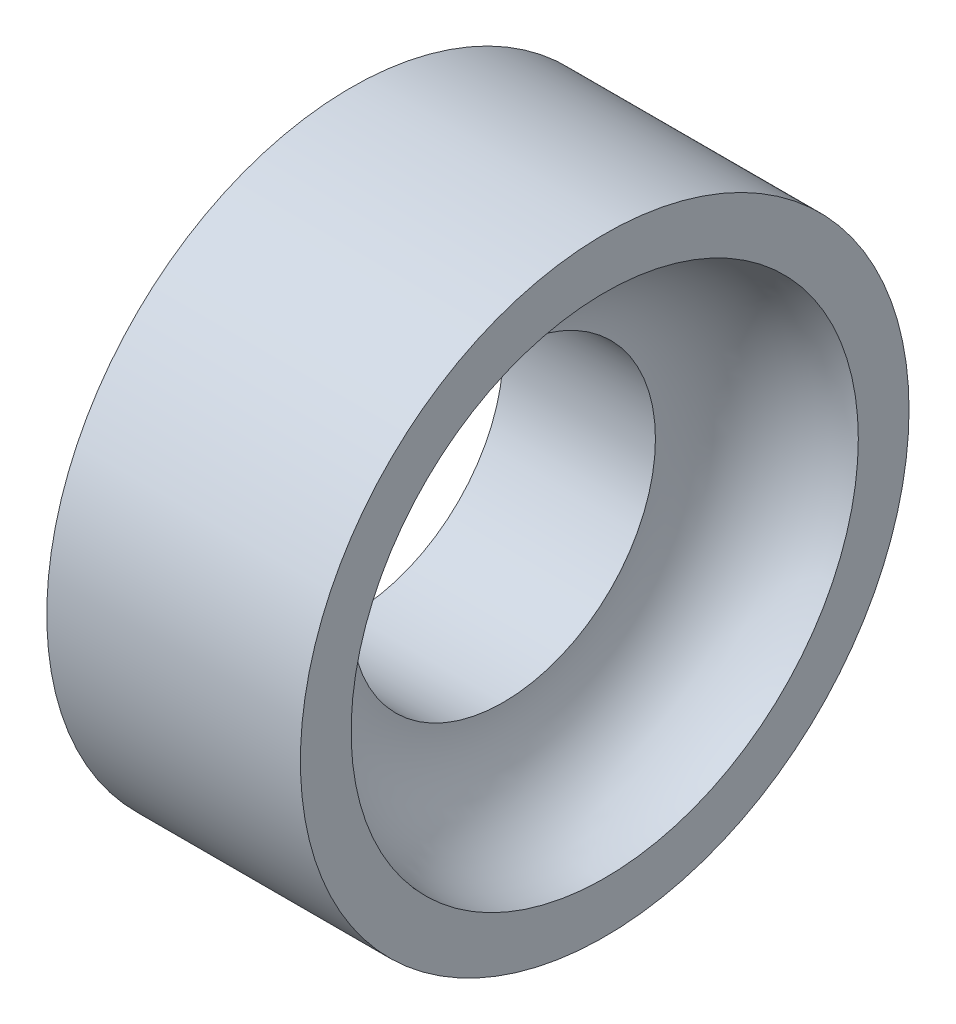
ISO-10303-21;
HEADER;
FILE_DESCRIPTION(('STEP AP214'),'2;1');
FILE_NAME('part.step','',(''),(''),'','','');
FILE_SCHEMA(('AUTOMOTIVE_DESIGN { 1 0 10303 214 1 1 1 1 }'));
ENDSEC;
DATA;
#1=APPLICATION_CONTEXT('core data for automotive mechanical design processes');
#2=APPLICATION_PROTOCOL_DEFINITION('international standard','automotive_design',2000,#1);
#3=PRODUCT_CONTEXT('',#1,'mechanical');
#4=PRODUCT('Part','Part','',(#3));
#5=PRODUCT_RELATED_PRODUCT_CATEGORY('part','',(#4));
#6=PRODUCT_DEFINITION_FORMATION('','',#4);
#7=PRODUCT_DEFINITION_CONTEXT('part definition',#1,'design');
#8=PRODUCT_DEFINITION('design','',#6,#7);
#9=PRODUCT_DEFINITION_SHAPE('','',#8);
#10=(LENGTH_UNIT() NAMED_UNIT(*) SI_UNIT(.MILLI.,.METRE.));
#11=(NAMED_UNIT(*) PLANE_ANGLE_UNIT() SI_UNIT($,.RADIAN.));
#12=(NAMED_UNIT(*) SI_UNIT($,.STERADIAN.) SOLID_ANGLE_UNIT());
#13=UNCERTAINTY_MEASURE_WITH_UNIT(LENGTH_MEASURE(1.E-05),#10,'distance_accuracy_value','');
#14=(GEOMETRIC_REPRESENTATION_CONTEXT(3) GLOBAL_UNCERTAINTY_ASSIGNED_CONTEXT((#13)) GLOBAL_UNIT_ASSIGNED_CONTEXT((#10,
#11,#12)) REPRESENTATION_CONTEXT('',''));
#15=CARTESIAN_POINT('',(0.,0.,0.));
#16=DIRECTION('',(0.,0.,1.));
#17=DIRECTION('',(1.,0.,0.));
#18=AXIS2_PLACEMENT_3D('',#15,#16,#17);
#19=CARTESIAN_POINT('',(0.,0.,0.));
#20=DIRECTION('',(-1.,0.,0.));
#21=DIRECTION('',(0.,0.,1.));
#22=AXIS2_PLACEMENT_3D('',#19,#20,#21);
#23=PLANE('',#22);
#24=CARTESIAN_POINT('',(0.,0.,0.));
#25=DIRECTION('',(1.,0.,0.));
#26=DIRECTION('',(0.,0.,-1.));
#27=AXIS2_PLACEMENT_3D('',#24,#25,#26);
#28=CIRCLE('',#27,6.);
#29=CARTESIAN_POINT('',(0.,0.,-6.));
#30=VERTEX_POINT('',#29);
#31=EDGE_CURVE('E46',#30,#30,#28,.T.);
#32=ORIENTED_EDGE('',*,*,#31,.T.);
#33=EDGE_LOOP('',(#32));
#34=FACE_BOUND('',#33,.T.);
#35=CARTESIAN_POINT('',(0.,0.,0.));
#36=DIRECTION('',(1.,0.,0.));
#37=DIRECTION('',(0.,0.,-1.));
#38=AXIS2_PLACEMENT_3D('',#35,#36,#37);
#39=CIRCLE('',#38,5.);
#40=CARTESIAN_POINT('',(0.,0.,-5.));
#41=VERTEX_POINT('',#40);
#42=EDGE_CURVE('E10',#41,#41,#39,.T.);
#43=ORIENTED_EDGE('',*,*,#42,.F.);
#44=EDGE_LOOP('',(#43));
#45=FACE_BOUND('',#44,.T.);
#46=ADVANCED_FACE('F30',(#34,#45),#23,.F.);
#47=CARTESIAN_POINT('',(-6.,0.,0.));
#48=DIRECTION('',(1.,0.,0.));
#49=DIRECTION('',(0.,0.,-1.));
#50=AXIS2_PLACEMENT_3D('',#47,#48,#49);
#51=CYLINDRICAL_SURFACE('',#50,3.);
#52=CARTESIAN_POINT('',(-5.,0.,0.));
#53=DIRECTION('',(1.,0.,0.));
#54=DIRECTION('',(0.,0.,-1.));
#55=AXIS2_PLACEMENT_3D('',#52,#53,#54);
#56=CIRCLE('',#55,3.);
#57=CARTESIAN_POINT('',(-5.,0.,-3.));
#58=VERTEX_POINT('',#57);
#59=EDGE_CURVE('E37',#58,#58,#56,.T.);
#60=ORIENTED_EDGE('',*,*,#59,.F.);
#61=EDGE_LOOP('',(#60));
#62=FACE_BOUND('',#61,.T.);
#63=CARTESIAN_POINT('',(-2.,0.,0.));
#64=DIRECTION('',(1.,0.,0.));
#65=DIRECTION('',(0.,0.,-1.));
#66=AXIS2_PLACEMENT_3D('',#63,#64,#65);
#67=CIRCLE('',#66,3.);
#68=CARTESIAN_POINT('',(-2.,0.,-3.));
#69=VERTEX_POINT('',#68);
#70=EDGE_CURVE('E33',#69,#69,#67,.T.);
#71=ORIENTED_EDGE('',*,*,#70,.T.);
#72=EDGE_LOOP('',(#71));
#73=FACE_BOUND('',#72,.T.);
#74=ADVANCED_FACE('F53',(#62,#73),#51,.F.);
#75=CARTESIAN_POINT('',(0.,0.,0.));
#76=DIRECTION('',(1.,0.,0.));
#77=DIRECTION('',(0.,0.,-1.));
#78=AXIS2_PLACEMENT_3D('',#75,#76,#77);
#79=CYLINDRICAL_SURFACE('',#78,6.);
#80=ORIENTED_EDGE('',*,*,#31,.F.);
#81=EDGE_LOOP('',(#80));
#82=FACE_BOUND('',#81,.T.);
#83=CARTESIAN_POINT('',(-5.,0.,0.));
#84=DIRECTION('',(1.,0.,0.));
#85=DIRECTION('',(0.,0.,-1.));
#86=AXIS2_PLACEMENT_3D('',#83,#84,#85);
#87=CIRCLE('',#86,6.);
#88=CARTESIAN_POINT('',(-5.,0.,-6.));
#89=VERTEX_POINT('',#88);
#90=EDGE_CURVE('E41',#89,#89,#87,.T.);
#91=ORIENTED_EDGE('',*,*,#90,.T.);
#92=EDGE_LOOP('',(#91));
#93=FACE_BOUND('',#92,.T.);
#94=ADVANCED_FACE('F62',(#82,#93),#79,.T.);
#95=CARTESIAN_POINT('',(-5.,-6.,0.));
#96=DIRECTION('',(1.,0.,0.));
#97=DIRECTION('',(0.,0.,-1.));
#98=AXIS2_PLACEMENT_3D('',#95,#96,#97);
#99=PLANE('',#98);
#100=ORIENTED_EDGE('',*,*,#59,.T.);
#101=EDGE_LOOP('',(#100));
#102=FACE_BOUND('',#101,.T.);
#103=ORIENTED_EDGE('',*,*,#90,.F.);
#104=EDGE_LOOP('',(#103));
#105=FACE_BOUND('',#104,.T.);
#106=ADVANCED_FACE('F57',(#102,#105),#99,.F.);
#107=CARTESIAN_POINT('',(0.,0.,0.));
#108=DIRECTION('',(1.,0.,0.));
#109=DIRECTION('',(0.,0.,-1.));
#110=AXIS2_PLACEMENT_3D('',#107,#108,#109);
#111=TOROIDAL_SURFACE('',#110,3.,2.);
#112=ORIENTED_EDGE('',*,*,#70,.F.);
#113=EDGE_LOOP('',(#112));
#114=FACE_BOUND('',#113,.T.);
#115=ORIENTED_EDGE('',*,*,#42,.T.);
#116=EDGE_LOOP('',(#115));
#117=FACE_BOUND('',#116,.T.);
#118=ADVANCED_FACE('F55',(#114,#117),#111,.F.);
#119=CLOSED_SHELL('',(#46,#74,#94,#106,#118));
#120=MANIFOLD_SOLID_BREP('B2',#119);
#121=ADVANCED_BREP_SHAPE_REPRESENTATION('',(#18,#120),#14);
#122=SHAPE_DEFINITION_REPRESENTATION(#9,#121);
ENDSEC;
END-ISO-10303-21;
